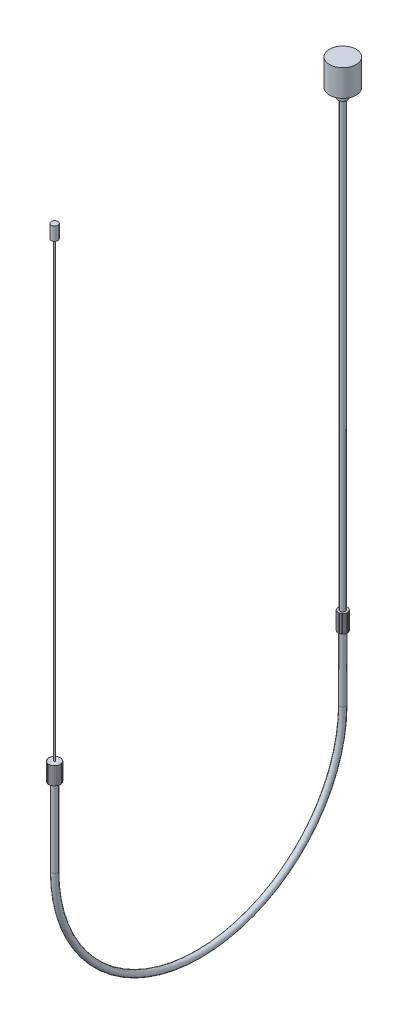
from build123d import *

# Parameters (mm, degrees)
CROQUIS1_R              = 30
SALIENTE_EXTRUIR1_DEPTH = 60
CROQUIS2_R              = 10
SALIENTE_EXTRUIR2_DEPTH = 20
CROQUIS3_R              = 6
SALIENTE_EXTRUIR3_DEPTH = 1000
CROQUIS4_R              = 10
SALIENTE_EXTRUIR4_DEPTH = 40
CROQUIS5_R              = 7
CORTAR_EXTRUIR1_DEPTH   = 30
BARRER1_PROFILE_R       = 6.75
CROQUIS35_W             = 1.5
CROQUIS35_H             = 1
SALIENTE_EXTRUIR5_DEPTH = 40
CROQUIS36_R             = 12.5
SALIENTE_EXTRUIR6_DEPTH = 39.8
CROQUIS37_W             = 1
CROQUIS37_H             = 2
SALIENTE_EXTRUIR7_DEPTH = 39.8
CROQUIS38_R             = 1.5
SALIENTE_EXTRUIR8_DEPTH = 1020
CROQUIS39_R             = 7.5
SALIENTE_EXTRUIR9_DEPTH = 30


with BuildPart() as part:
    # Croquis1 → Saliente-Extruir1 (new body)
    with BuildSketch(Plane(origin=(0, 0, 0), x_dir=(1, 0, 0), z_dir=(0, 1, 0))):
        with Locations(Location((0, 0, 0), (0, 0, 90))):
            Circle(CROQUIS1_R)
    extrude(amount=SALIENTE_EXTRUIR1_DEPTH)


with BuildPart() as body_2:
    # Croquis2 → Saliente-Extruir2 (new body)
    with BuildSketch(Plane.XZ):
        with Locations(Location((0, 0, 0), (0, 0, 270))):
            Circle(CROQUIS2_R)
    extrude(amount=SALIENTE_EXTRUIR2_DEPTH)


with BuildPart() as body_3:
    # Croquis3 → Saliente-Extruir3 (new body)
    with BuildSketch(Plane.XZ.offset(20)):
        with Locations(Location((0, 0, 0), (0, 0, 270))):
            Circle(CROQUIS3_R)
    extrude(amount=SALIENTE_EXTRUIR3_DEPTH)


with BuildPart() as body_4:
    # Croquis4 → Saliente-Extruir4 (new body)
    with BuildSketch(Plane.XZ.offset(1020)):
        with Locations(Location((0, 0, 0), (0, 0, 270))):
            Circle(CROQUIS4_R)
    extrude(amount=SALIENTE_EXTRUIR4_DEPTH)

    # Croquis5 → Cortar-Extruir1 (cut)
    with BuildSketch(Plane.XZ.offset(1060)):
        with Locations(Location((0, 0, 0), (0, 0, 270))):
            Circle(CROQUIS5_R)
    extrude(amount=-CORTAR_EXTRUIR1_DEPTH, mode=Mode.SUBTRACT)

    # Croquis35 → Saliente-Extruir5 (add)
    with BuildSketch(Plane(origin=(0, -1020, 0), x_dir=(1, 0, 0), z_dir=(0, 1, 0))):
        Polygon((3.337681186, 9.983605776), (3.088991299, 9.015022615), (1.636116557, 9.388057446), (1.884806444, 10.356640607), align=None)
        with Locations((0, 10)):
            Rectangle(CROQUIS35_W, CROQUIS35_H)
        Polygon((5.715643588, 8.839904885), (5.233889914, 7.963598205), (3.919429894, 8.686228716), (4.401183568, 9.562535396), align=None)
        Polygon((7.734471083, 7.140760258), (7.049923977, 6.411791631), (5.956471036, 7.43861229), (6.641018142, 8.167580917), align=None)
        Polygon((9.267313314, 4.992935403), (8.422985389, 4.457108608), (7.619245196, 5.723600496), (8.463573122, 6.259427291), align=None)
        Polygon((10.217856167, 2.531386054), (9.266799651, 2.222369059), (8.803274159, 3.648953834), (9.754330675, 3.957970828), align=None)
        Polygon((10.526373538, -0.089219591), (9.52834681, -0.152010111), (9.43416103, 1.345029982), (10.432187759, 1.407820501), align=None)
        Polygon((10.173480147, -2.704219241), (9.191192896, -2.516837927), (9.472264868, -1.043407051), (10.454552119, -1.230788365), align=None)
        Polygon((9.181349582, -5.149302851), (8.27652253, -4.723523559), (8.915191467, -3.366282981), (9.82001852, -3.792062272), align=None)
        Polygon((7.612321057, -7.270836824), (6.841807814, -6.633412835), (7.797943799, -5.477642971), (8.568457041, -6.11506696), align=None)
        Polygon((5.564982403, -8.93551738), (4.977197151, -8.126500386), (6.190722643, -7.244822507), (6.778507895, -8.053839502), align=None)
        Polygon((3.167975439, -10.038746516), (2.799850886, -9.10897003), (4.194515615, -8.556783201), (4.562640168, -9.486559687), align=None)
        Polygon((0.571912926, -10.511204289), (0.446579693, -9.519089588), (1.934751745, -9.331089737), (2.060084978, -10.323204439), align=None)
        Polygon((-2.060084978, -10.323204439), (-1.934751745, -9.331089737), (-0.446579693, -9.519089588), (-0.571912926, -10.511204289), align=None)
        Polygon((-4.562640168, -9.486559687), (-4.194515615, -8.556783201), (-2.799850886, -9.10897003), (-3.167975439, -10.038746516), align=None)
        Polygon((-6.778507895, -8.053839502), (-6.190722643, -7.244822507), (-4.977197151, -8.126500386), (-5.564982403, -8.93551738), align=None)
        Polygon((-8.568457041, -6.11506696), (-7.797943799, -5.477642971), (-6.841807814, -6.633412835), (-7.612321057, -7.270836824), align=None)
        Polygon((-9.82001852, -3.792062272), (-8.915191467, -3.366282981), (-8.27652253, -4.723523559), (-9.181349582, -5.149302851), align=None)
        Polygon((-10.454552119, -1.230788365), (-9.472264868, -1.043407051), (-9.191192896, -2.516837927), (-10.173480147, -2.704219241), align=None)
        Polygon((-10.432187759, 1.407820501), (-9.43416103, 1.345029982), (-9.52834681, -0.152010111), (-10.526373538, -0.089219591), align=None)
        Polygon((-9.754330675, 3.957970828), (-8.803274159, 3.648953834), (-9.266799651, 2.222369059), (-10.217856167, 2.531386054), align=None)
        Polygon((-8.463573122, 6.259427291), (-7.619245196, 5.723600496), (-8.422985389, 4.457108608), (-9.267313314, 4.992935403), align=None)
        Polygon((-6.641018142, 8.167580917), (-5.956471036, 7.43861229), (-7.049923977, 6.411791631), (-7.734471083, 7.140760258), align=None)
        Polygon((-4.401183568, 9.562535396), (-3.919429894, 8.686228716), (-5.233889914, 7.963598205), (-5.715643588, 8.839904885), align=None)
        Polygon((-1.884806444, 10.356640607), (-1.636116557, 9.388057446), (-3.088991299, 9.015022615), (-3.337681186, 9.983605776), align=None)
    extrude(amount=-SALIENTE_EXTRUIR5_DEPTH)


with BuildPart() as body_5:
    # Barrer1: sweep along a path in Croquis6
    with BuildLine(Plane(origin=(0, 0, 0), x_dir=(0, 0, -1), z_dir=(1, 0, 0))) as barrer1_path:
        Line((0, -1030), (0, -1205))
        ThreePointArc((0, -1205), (-325, -1530), (-650, -1205))
        Line((-650, -1205), (-650, -1030))
    # Barrer1 profile (on start of the path) → Barrer1 (sweep)
    with BuildSketch(Plane(origin=(0, -1030, 0), x_dir=(0, 0, -1), z_dir=(0, -1, 0))):
        Circle(BARRER1_PROFILE_R)
    sweep(path=barrer1_path.line)


with BuildPart() as body_6:
    # Croquis36 → Saliente-Extruir6 (new body)
    with BuildSketch(Plane(origin=(0, -1030, 0), x_dir=(1, 0, 0), z_dir=(0, 1, 0))):
        with Locations(Location((0, -650, 0), (0, 0, 90))):
            Circle(CROQUIS36_R)
    extrude(amount=SALIENTE_EXTRUIR6_DEPTH)

    # Croquis37 → Saliente-Extruir7 (add)
    with BuildSketch(Plane(origin=(0, -990.2, 0), x_dir=(1, 0, 0), z_dir=(0, 1, 0))):
        Polygon((-11.871687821, -647.984304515), (-11.374308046, -646.047138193), (-12.342891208, -645.798448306), (-12.840270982, -647.735614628), align=None)
        with Locations((-12.5, -650)):
            Rectangle(CROQUIS37_W, CROQUIS37_H)
        Polygon((-10.997433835, -645.095262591), (-10.033926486, -643.342649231), (-10.910233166, -642.860895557), (-11.873740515, -644.613508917), align=None)
        Polygon((-9.432170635, -642.514403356), (-8.063076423, -641.056466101), (-8.792045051, -640.371918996), (-10.161139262, -641.82985625), align=None)
        Polygon((-7.274249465, -640.403891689), (-5.585593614, -639.332238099), (-6.121420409, -638.487910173), (-7.81007626, -639.559563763), align=None)
        Polygon((-4.659260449, -638.896338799), (-2.757147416, -638.27830481), (-3.066164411, -637.327248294), (-4.968277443, -637.945282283), align=None)
        Polygon((-1.751512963, -638.086469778), (0.244540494, -637.960888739), (0.181749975, -636.962862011), (-1.814303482, -637.08844305), align=None)
        Polygon((1.266288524, -638.025171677), (3.230863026, -638.399934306), (3.41824434, -637.417647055), (1.453669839, -637.042884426), align=None)
        Polygon((4.204524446, -638.716296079), (6.014178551, -639.567854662), (6.439957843, -638.66302761), (4.630303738, -637.811469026), align=None)
        Polygon((6.878574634, -640.116417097), (8.41960112, -641.391265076), (9.05702511, -640.620751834), (7.515998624, -639.345903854), align=None)
        Polygon((9.12041868, -642.137559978), (10.295989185, -643.755593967), (11.105006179, -643.167808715), (9.929435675, -641.549774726), align=None)
        Polygon((10.789193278, -644.652728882), (11.525442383, -646.512281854), (12.455218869, -646.144157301), (11.718969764, -644.284604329), align=None)
        Polygon((11.780043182, -647.503886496), (12.030709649, -649.488115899), (13.022824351, -649.362782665), (12.772157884, -647.378553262), align=None)
        Polygon((12.030709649, -650.511884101), (11.780043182, -652.496113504), (12.772157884, -652.621446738), (13.022824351, -650.637217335), align=None)
        Polygon((11.525442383, -653.487718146), (10.789193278, -655.347271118), (11.718969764, -655.715395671), (12.455218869, -653.855842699), align=None)
        Polygon((10.295989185, -656.244406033), (9.12041868, -657.862440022), (9.929435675, -658.450225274), (11.105006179, -656.832191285), align=None)
        Polygon((8.41960112, -658.608734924), (6.878574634, -659.883582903), (7.515998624, -660.654096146), (9.05702511, -659.379248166), align=None)
        Polygon((6.014178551, -660.432145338), (4.204524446, -661.283703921), (4.630303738, -662.188530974), (6.439957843, -661.33697239), align=None)
        Polygon((3.230863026, -661.600065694), (1.266288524, -661.974828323), (1.453669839, -662.957115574), (3.41824434, -662.582352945), align=None)
        Polygon((0.244540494, -662.039111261), (-1.751512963, -661.913530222), (-1.814303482, -662.91155695), (0.181749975, -663.037137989), align=None)
        Polygon((-2.757147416, -661.72169519), (-4.659260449, -661.103661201), (-4.968277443, -662.054717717), (-3.066164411, -662.672751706), align=None)
        Polygon((-5.585593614, -660.667761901), (-7.274249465, -659.596108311), (-7.81007626, -660.440436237), (-6.121420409, -661.512089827), align=None)
        Polygon((-8.063076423, -658.943533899), (-9.432170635, -657.485596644), (-10.161139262, -658.17014375), (-8.792045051, -659.628081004), align=None)
        Polygon((-10.033926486, -656.657350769), (-10.997433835, -654.904737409), (-11.873740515, -655.386491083), (-10.910233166, -657.139104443), align=None)
        Polygon((-11.374308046, -653.952861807), (-11.871687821, -652.015695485), (-12.840270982, -652.264385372), (-12.342891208, -654.201551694), align=None)
    extrude(amount=-SALIENTE_EXTRUIR7_DEPTH)


with BuildPart() as body_7:
    # Croquis38 → Saliente-Extruir8 (new body)
    with BuildSketch(Plane(origin=(0, -990.2, 0), x_dir=(1, 0, 0), z_dir=(0, 1, 0))):
        with Locations(Location((0, -650, 0), (0, 0, 270))):
            Circle(CROQUIS38_R)
    extrude(amount=SALIENTE_EXTRUIR8_DEPTH)


with BuildPart() as body_8:
    # Croquis39 → Saliente-Extruir9 (new body)
    with BuildSketch(Plane(origin=(0, 29.8, 0), x_dir=(1, 0, 0), z_dir=(0, 1, 0))):
        with Locations(Location((0, -650, 0), (0, 0, 270))):
            Circle(CROQUIS39_R)
    extrude(amount=SALIENTE_EXTRUIR9_DEPTH)


solid = Compound([part.part, body_2.part, body_3.part, body_4.part, body_5.part, body_6.part, body_7.part, body_8.part])
